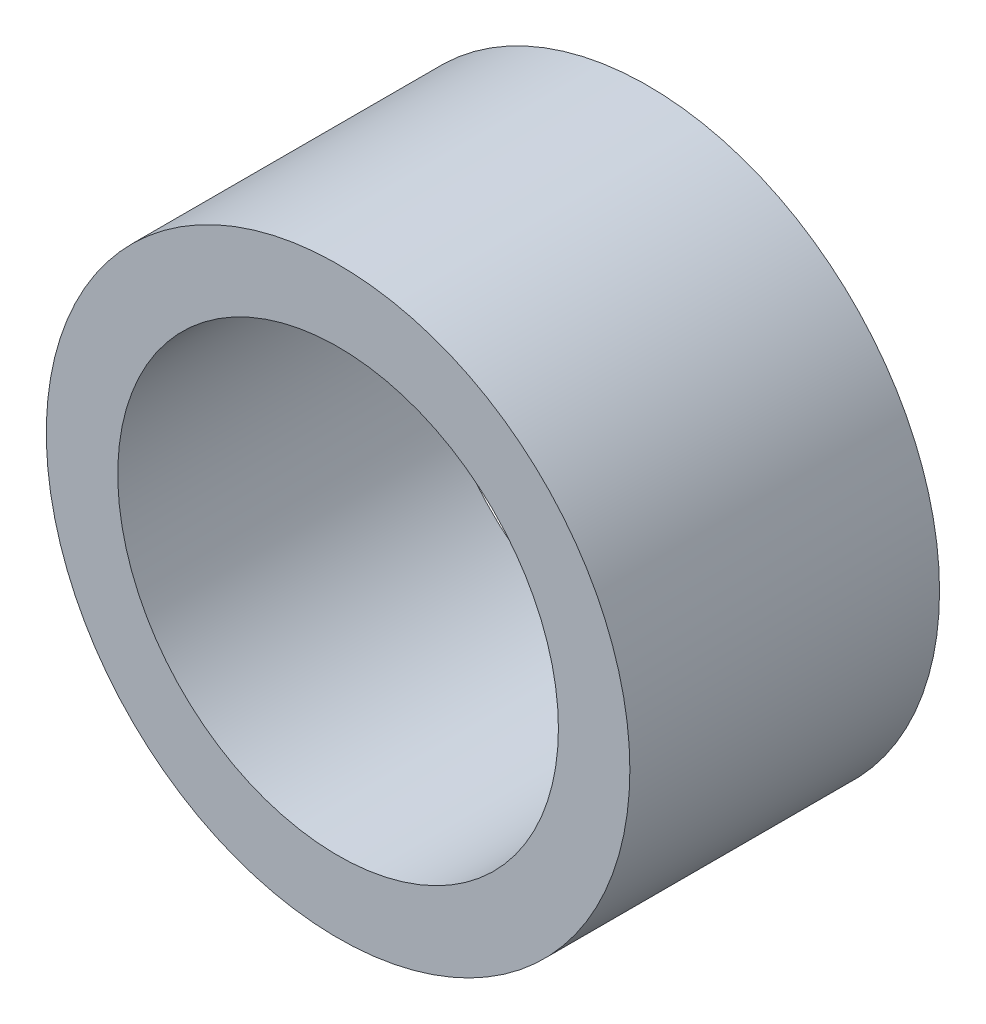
from build123d import *

# Parameters (mm, degrees)
ESQUISSE1_R        = 12.25
ESQUISSE1_R_2      = 9.25
EXTRU_MINCE1_DEPTH = 13


with BuildPart() as part:
    # Esquisse1 → Extru.-Mince1 (new body)
    with BuildSketch(Plane.XY):
        Circle(ESQUISSE1_R)
        Circle(ESQUISSE1_R_2, mode=Mode.SUBTRACT)
    extrude(amount=-EXTRU_MINCE1_DEPTH)


solid = part.part
